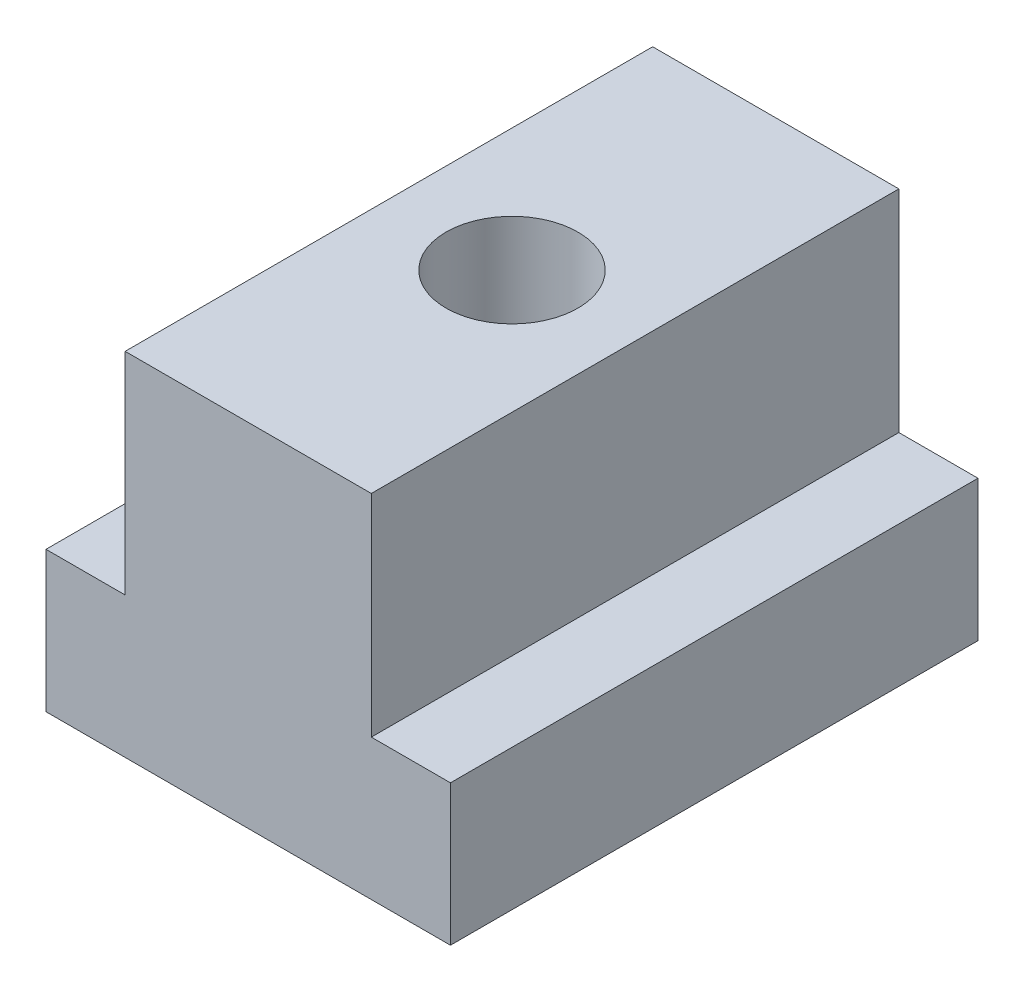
ISO-10303-21;
HEADER;
FILE_DESCRIPTION(('STEP AP214'),'2;1');
FILE_NAME('part.step','',(''),(''),'','','');
FILE_SCHEMA(('AUTOMOTIVE_DESIGN { 1 0 10303 214 1 1 1 1 }'));
ENDSEC;
DATA;
#1=APPLICATION_CONTEXT('core data for automotive mechanical design processes');
#2=APPLICATION_PROTOCOL_DEFINITION('international standard','automotive_design',2000,#1);
#3=PRODUCT_CONTEXT('',#1,'mechanical');
#4=PRODUCT('Part','Part','',(#3));
#5=PRODUCT_RELATED_PRODUCT_CATEGORY('part','',(#4));
#6=PRODUCT_DEFINITION_FORMATION('','',#4);
#7=PRODUCT_DEFINITION_CONTEXT('part definition',#1,'design');
#8=PRODUCT_DEFINITION('design','',#6,#7);
#9=PRODUCT_DEFINITION_SHAPE('','',#8);
#10=(LENGTH_UNIT() NAMED_UNIT(*) SI_UNIT(.MILLI.,.METRE.));
#11=(NAMED_UNIT(*) PLANE_ANGLE_UNIT() SI_UNIT($,.RADIAN.));
#12=(NAMED_UNIT(*) SI_UNIT($,.STERADIAN.) SOLID_ANGLE_UNIT());
#13=UNCERTAINTY_MEASURE_WITH_UNIT(LENGTH_MEASURE(1.E-05),#10,'distance_accuracy_value','');
#14=(GEOMETRIC_REPRESENTATION_CONTEXT(3) GLOBAL_UNCERTAINTY_ASSIGNED_CONTEXT((#13)) GLOBAL_UNIT_ASSIGNED_CONTEXT((#10,
#11,#12)) REPRESENTATION_CONTEXT('',''));
#15=CARTESIAN_POINT('',(0.,0.,0.));
#16=DIRECTION('',(0.,0.,1.));
#17=DIRECTION('',(1.,0.,0.));
#18=AXIS2_PLACEMENT_3D('',#15,#16,#17);
#19=CARTESIAN_POINT('',(-11.5,8.,15.));
#20=DIRECTION('',(0.,-1.,0.));
#21=DIRECTION('',(1.,0.,0.));
#22=AXIS2_PLACEMENT_3D('',#19,#20,#21);
#23=PLANE('',#22);
#24=DIRECTION('',(-1.,0.,0.));
#25=VECTOR('',#24,1.);
#26=CARTESIAN_POINT('',(-11.5,8.,-15.));
#27=LINE('',#26,#25);
#28=CARTESIAN_POINT('',(-7.,8.00000000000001,-15.));
#29=VERTEX_POINT('',#28);
#30=CARTESIAN_POINT('',(-11.5,8.,-15.));
#31=VERTEX_POINT('',#30);
#32=EDGE_CURVE('E127',#29,#31,#27,.T.);
#33=ORIENTED_EDGE('',*,*,#32,.T.);
#34=DIRECTION('',(0.,0.,-1.));
#35=VECTOR('',#34,1.);
#36=CARTESIAN_POINT('',(-11.5,8.,15.));
#37=LINE('',#36,#35);
#38=CARTESIAN_POINT('',(-11.5,8.,15.));
#39=VERTEX_POINT('',#38);
#40=EDGE_CURVE('E11',#39,#31,#37,.T.);
#41=ORIENTED_EDGE('',*,*,#40,.F.);
#42=DIRECTION('',(-1.,0.,0.));
#43=VECTOR('',#42,1.);
#44=CARTESIAN_POINT('',(-11.5,8.,15.));
#45=LINE('',#44,#43);
#46=CARTESIAN_POINT('',(-7.,8.00000000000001,15.));
#47=VERTEX_POINT('',#46);
#48=EDGE_CURVE('E142',#47,#39,#45,.T.);
#49=ORIENTED_EDGE('',*,*,#48,.F.);
#50=DIRECTION('',(0.,0.,-1.));
#51=VECTOR('',#50,1.);
#52=CARTESIAN_POINT('',(-7.,8.00000000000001,15.));
#53=LINE('',#52,#51);
#54=EDGE_CURVE('E123',#47,#29,#53,.T.);
#55=ORIENTED_EDGE('',*,*,#54,.T.);
#56=EDGE_LOOP('',(#33,#41,#49,#55));
#57=FACE_BOUND('',#56,.T.);
#58=ADVANCED_FACE('F31',(#57),#23,.F.);
#59=CARTESIAN_POINT('',(-11.5,0.,15.));
#60=DIRECTION('',(1.,0.,0.));
#61=DIRECTION('',(0.,1.,0.));
#62=AXIS2_PLACEMENT_3D('',#59,#60,#61);
#63=PLANE('',#62);
#64=DIRECTION('',(0.,-1.,0.));
#65=VECTOR('',#64,1.);
#66=CARTESIAN_POINT('',(-11.5,0.,-15.));
#67=LINE('',#66,#65);
#68=CARTESIAN_POINT('',(-11.5,0.,-15.));
#69=VERTEX_POINT('',#68);
#70=EDGE_CURVE('E130',#31,#69,#67,.T.);
#71=ORIENTED_EDGE('',*,*,#70,.T.);
#72=DIRECTION('',(0.,0.,-1.));
#73=VECTOR('',#72,1.);
#74=CARTESIAN_POINT('',(-11.5,0.,15.));
#75=LINE('',#74,#73);
#76=CARTESIAN_POINT('',(-11.5,0.,15.));
#77=VERTEX_POINT('',#76);
#78=EDGE_CURVE('E39',#77,#69,#75,.T.);
#79=ORIENTED_EDGE('',*,*,#78,.F.);
#80=DIRECTION('',(0.,-1.,0.));
#81=VECTOR('',#80,1.);
#82=CARTESIAN_POINT('',(-11.5,0.,15.));
#83=LINE('',#82,#81);
#84=EDGE_CURVE('E90',#39,#77,#83,.T.);
#85=ORIENTED_EDGE('',*,*,#84,.F.);
#86=ORIENTED_EDGE('',*,*,#40,.T.);
#87=EDGE_LOOP('',(#71,#79,#85,#86));
#88=FACE_BOUND('',#87,.T.);
#89=ADVANCED_FACE('F198',(#88),#63,.F.);
#90=CARTESIAN_POINT('',(-11.5,0.,15.));
#91=DIRECTION('',(0.,1.,0.));
#92=DIRECTION('',(-1.,0.,0.));
#93=AXIS2_PLACEMENT_3D('',#90,#91,#92);
#94=PLANE('',#93);
#95=CARTESIAN_POINT('',(0.,0.,0.));
#96=DIRECTION('',(0.,1.,0.));
#97=DIRECTION('',(-1.,0.,0.));
#98=AXIS2_PLACEMENT_3D('',#95,#96,#97);
#99=CIRCLE('',#98,3.75);
#100=CARTESIAN_POINT('',(-3.75,0.,0.));
#101=VERTEX_POINT('',#100);
#102=EDGE_CURVE('E131',#101,#101,#99,.T.);
#103=ORIENTED_EDGE('',*,*,#102,.T.);
#104=EDGE_LOOP('',(#103));
#105=FACE_BOUND('',#104,.T.);
#106=DIRECTION('',(1.,0.,0.));
#107=VECTOR('',#106,1.);
#108=CARTESIAN_POINT('',(-11.5,0.,-15.));
#109=LINE('',#108,#107);
#110=CARTESIAN_POINT('',(11.5,0.,-15.));
#111=VERTEX_POINT('',#110);
#112=EDGE_CURVE('E133',#69,#111,#109,.T.);
#113=ORIENTED_EDGE('',*,*,#112,.T.);
#114=DIRECTION('',(0.,0.,-1.));
#115=VECTOR('',#114,1.);
#116=CARTESIAN_POINT('',(11.5,0.,15.));
#117=LINE('',#116,#115);
#118=CARTESIAN_POINT('',(11.5,0.,15.));
#119=VERTEX_POINT('',#118);
#120=EDGE_CURVE('E149',#119,#111,#117,.T.);
#121=ORIENTED_EDGE('',*,*,#120,.F.);
#122=DIRECTION('',(1.,0.,0.));
#123=VECTOR('',#122,1.);
#124=CARTESIAN_POINT('',(-11.5,0.,15.));
#125=LINE('',#124,#123);
#126=EDGE_CURVE('E157',#77,#119,#125,.T.);
#127=ORIENTED_EDGE('',*,*,#126,.F.);
#128=ORIENTED_EDGE('',*,*,#78,.T.);
#129=EDGE_LOOP('',(#113,#121,#127,#128));
#130=FACE_BOUND('',#129,.T.);
#131=ADVANCED_FACE('F155',(#105,#130),#94,.F.);
#132=CARTESIAN_POINT('',(11.5,0.,15.));
#133=DIRECTION('',(-1.,0.,0.));
#134=DIRECTION('',(0.,0.,1.));
#135=AXIS2_PLACEMENT_3D('',#132,#133,#134);
#136=PLANE('',#135);
#137=DIRECTION('',(0.,1.,0.));
#138=VECTOR('',#137,1.);
#139=CARTESIAN_POINT('',(11.5,0.,-15.));
#140=LINE('',#139,#138);
#141=CARTESIAN_POINT('',(11.5,8.,-15.));
#142=VERTEX_POINT('',#141);
#143=EDGE_CURVE('E135',#111,#142,#140,.T.);
#144=ORIENTED_EDGE('',*,*,#143,.T.);
#145=DIRECTION('',(0.,0.,-1.));
#146=VECTOR('',#145,1.);
#147=CARTESIAN_POINT('',(11.5,8.,15.));
#148=LINE('',#147,#146);
#149=CARTESIAN_POINT('',(11.5,8.,15.));
#150=VERTEX_POINT('',#149);
#151=EDGE_CURVE('E146',#150,#142,#148,.T.);
#152=ORIENTED_EDGE('',*,*,#151,.F.);
#153=DIRECTION('',(0.,1.,0.));
#154=VECTOR('',#153,1.);
#155=CARTESIAN_POINT('',(11.5,0.,15.));
#156=LINE('',#155,#154);
#157=EDGE_CURVE('E169',#119,#150,#156,.T.);
#158=ORIENTED_EDGE('',*,*,#157,.F.);
#159=ORIENTED_EDGE('',*,*,#120,.T.);
#160=EDGE_LOOP('',(#144,#152,#158,#159));
#161=FACE_BOUND('',#160,.T.);
#162=ADVANCED_FACE('F165',(#161),#136,.F.);
#163=CARTESIAN_POINT('',(11.5,8.,15.));
#164=DIRECTION('',(0.,-1.,0.));
#165=DIRECTION('',(1.,0.,0.));
#166=AXIS2_PLACEMENT_3D('',#163,#164,#165);
#167=PLANE('',#166);
#168=DIRECTION('',(-1.,0.,0.));
#169=VECTOR('',#168,1.);
#170=CARTESIAN_POINT('',(11.5,8.,-15.));
#171=LINE('',#170,#169);
#172=CARTESIAN_POINT('',(7.,8.00000000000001,-15.));
#173=VERTEX_POINT('',#172);
#174=EDGE_CURVE('E137',#142,#173,#171,.T.);
#175=ORIENTED_EDGE('',*,*,#174,.T.);
#176=DIRECTION('',(0.,0.,-1.));
#177=VECTOR('',#176,1.);
#178=CARTESIAN_POINT('',(7.,8.00000000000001,15.));
#179=LINE('',#178,#177);
#180=CARTESIAN_POINT('',(7.,8.00000000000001,15.));
#181=VERTEX_POINT('',#180);
#182=EDGE_CURVE('E118',#181,#173,#179,.T.);
#183=ORIENTED_EDGE('',*,*,#182,.F.);
#184=DIRECTION('',(-1.,0.,0.));
#185=VECTOR('',#184,1.);
#186=CARTESIAN_POINT('',(11.5,8.,15.));
#187=LINE('',#186,#185);
#188=EDGE_CURVE('E109',#150,#181,#187,.T.);
#189=ORIENTED_EDGE('',*,*,#188,.F.);
#190=ORIENTED_EDGE('',*,*,#151,.T.);
#191=EDGE_LOOP('',(#175,#183,#189,#190));
#192=FACE_BOUND('',#191,.T.);
#193=ADVANCED_FACE('F168',(#192),#167,.F.);
#194=CARTESIAN_POINT('',(7.,8.00000000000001,15.));
#195=DIRECTION('',(-1.,0.,0.));
#196=DIRECTION('',(0.,-1.,0.));
#197=AXIS2_PLACEMENT_3D('',#194,#195,#196);
#198=PLANE('',#197);
#199=DIRECTION('',(0.,1.,0.));
#200=VECTOR('',#199,1.);
#201=CARTESIAN_POINT('',(7.,8.00000000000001,-15.));
#202=LINE('',#201,#200);
#203=CARTESIAN_POINT('',(7.,20.,-15.));
#204=VERTEX_POINT('',#203);
#205=EDGE_CURVE('E117',#173,#204,#202,.T.);
#206=ORIENTED_EDGE('',*,*,#205,.T.);
#207=DIRECTION('',(0.,0.,-1.));
#208=VECTOR('',#207,1.);
#209=CARTESIAN_POINT('',(7.,20.,15.));
#210=LINE('',#209,#208);
#211=CARTESIAN_POINT('',(7.,20.,15.));
#212=VERTEX_POINT('',#211);
#213=EDGE_CURVE('E114',#212,#204,#210,.T.);
#214=ORIENTED_EDGE('',*,*,#213,.F.);
#215=DIRECTION('',(0.,1.,0.));
#216=VECTOR('',#215,1.);
#217=CARTESIAN_POINT('',(7.,8.00000000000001,15.));
#218=LINE('',#217,#216);
#219=EDGE_CURVE('E103',#181,#212,#218,.T.);
#220=ORIENTED_EDGE('',*,*,#219,.F.);
#221=ORIENTED_EDGE('',*,*,#182,.T.);
#222=EDGE_LOOP('',(#206,#214,#220,#221));
#223=FACE_BOUND('',#222,.T.);
#224=ADVANCED_FACE('F115',(#223),#198,.F.);
#225=CARTESIAN_POINT('',(7.,20.,15.));
#226=DIRECTION('',(0.,-1.,0.));
#227=DIRECTION('',(1.,0.,0.));
#228=AXIS2_PLACEMENT_3D('',#225,#226,#227);
#229=PLANE('',#228);
#230=CARTESIAN_POINT('',(0.,20.,0.));
#231=DIRECTION('',(0.,1.,0.));
#232=DIRECTION('',(-1.,0.,0.));
#233=AXIS2_PLACEMENT_3D('',#230,#231,#232);
#234=CIRCLE('',#233,3.75);
#235=CARTESIAN_POINT('',(-3.75,20.,0.));
#236=VERTEX_POINT('',#235);
#237=EDGE_CURVE('E175',#236,#236,#234,.T.);
#238=ORIENTED_EDGE('',*,*,#237,.F.);
#239=EDGE_LOOP('',(#238));
#240=FACE_BOUND('',#239,.T.);
#241=DIRECTION('',(-1.,0.,0.));
#242=VECTOR('',#241,1.);
#243=CARTESIAN_POINT('',(7.,20.,-15.));
#244=LINE('',#243,#242);
#245=CARTESIAN_POINT('',(-7.00000000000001,20.,-15.));
#246=VERTEX_POINT('',#245);
#247=EDGE_CURVE('E76',#204,#246,#244,.T.);
#248=ORIENTED_EDGE('',*,*,#247,.T.);
#249=DIRECTION('',(0.,0.,-1.));
#250=VECTOR('',#249,1.);
#251=CARTESIAN_POINT('',(-7.00000000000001,20.,15.));
#252=LINE('',#251,#250);
#253=CARTESIAN_POINT('',(-7.00000000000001,20.,15.));
#254=VERTEX_POINT('',#253);
#255=EDGE_CURVE('E119',#254,#246,#252,.T.);
#256=ORIENTED_EDGE('',*,*,#255,.F.);
#257=DIRECTION('',(-1.,0.,0.));
#258=VECTOR('',#257,1.);
#259=CARTESIAN_POINT('',(7.,20.,15.));
#260=LINE('',#259,#258);
#261=EDGE_CURVE('E107',#212,#254,#260,.T.);
#262=ORIENTED_EDGE('',*,*,#261,.F.);
#263=ORIENTED_EDGE('',*,*,#213,.T.);
#264=EDGE_LOOP('',(#248,#256,#262,#263));
#265=FACE_BOUND('',#264,.T.);
#266=ADVANCED_FACE('F121',(#240,#265),#229,.F.);
#267=CARTESIAN_POINT('',(-7.,8.00000000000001,15.));
#268=DIRECTION('',(1.,0.,0.));
#269=DIRECTION('',(0.,1.,0.));
#270=AXIS2_PLACEMENT_3D('',#267,#268,#269);
#271=PLANE('',#270);
#272=DIRECTION('',(0.,-1.,0.));
#273=VECTOR('',#272,1.);
#274=CARTESIAN_POINT('',(-7.,8.00000000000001,-15.));
#275=LINE('',#274,#273);
#276=EDGE_CURVE('E82',#246,#29,#275,.T.);
#277=ORIENTED_EDGE('',*,*,#276,.T.);
#278=ORIENTED_EDGE('',*,*,#54,.F.);
#279=DIRECTION('',(0.,-1.,0.));
#280=VECTOR('',#279,1.);
#281=CARTESIAN_POINT('',(-7.,8.00000000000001,15.));
#282=LINE('',#281,#280);
#283=EDGE_CURVE('E47',#254,#47,#282,.T.);
#284=ORIENTED_EDGE('',*,*,#283,.F.);
#285=ORIENTED_EDGE('',*,*,#255,.T.);
#286=EDGE_LOOP('',(#277,#278,#284,#285));
#287=FACE_BOUND('',#286,.T.);
#288=ADVANCED_FACE('F189',(#287),#271,.F.);
#289=CARTESIAN_POINT('',(-7.,8.00000000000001,15.));
#290=DIRECTION('',(0.,0.,1.));
#291=DIRECTION('',(1.,0.,0.));
#292=AXIS2_PLACEMENT_3D('',#289,#290,#291);
#293=PLANE('',#292);
#294=ORIENTED_EDGE('',*,*,#48,.T.);
#295=ORIENTED_EDGE('',*,*,#84,.T.);
#296=ORIENTED_EDGE('',*,*,#126,.T.);
#297=ORIENTED_EDGE('',*,*,#157,.T.);
#298=ORIENTED_EDGE('',*,*,#188,.T.);
#299=ORIENTED_EDGE('',*,*,#219,.T.);
#300=ORIENTED_EDGE('',*,*,#261,.T.);
#301=ORIENTED_EDGE('',*,*,#283,.T.);
#302=EDGE_LOOP('',(#294,#295,#296,#297,#298,#299,#300,#301));
#303=FACE_BOUND('',#302,.T.);
#304=ADVANCED_FACE('F105',(#303),#293,.T.);
#305=CARTESIAN_POINT('',(-7.,8.00000000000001,-15.));
#306=DIRECTION('',(0.,0.,1.));
#307=DIRECTION('',(1.,0.,0.));
#308=AXIS2_PLACEMENT_3D('',#305,#306,#307);
#309=PLANE('',#308);
#310=ORIENTED_EDGE('',*,*,#32,.F.);
#311=ORIENTED_EDGE('',*,*,#276,.F.);
#312=ORIENTED_EDGE('',*,*,#247,.F.);
#313=ORIENTED_EDGE('',*,*,#205,.F.);
#314=ORIENTED_EDGE('',*,*,#174,.F.);
#315=ORIENTED_EDGE('',*,*,#143,.F.);
#316=ORIENTED_EDGE('',*,*,#112,.F.);
#317=ORIENTED_EDGE('',*,*,#70,.F.);
#318=EDGE_LOOP('',(#310,#311,#312,#313,#314,#315,#316,#317));
#319=FACE_BOUND('',#318,.T.);
#320=ADVANCED_FACE('F161',(#319),#309,.F.);
#321=CARTESIAN_POINT('',(0.,0.,0.));
#322=DIRECTION('',(0.,1.,0.));
#323=DIRECTION('',(-1.,0.,0.));
#324=AXIS2_PLACEMENT_3D('',#321,#322,#323);
#325=CYLINDRICAL_SURFACE('',#324,3.75);
#326=ORIENTED_EDGE('',*,*,#102,.F.);
#327=EDGE_LOOP('',(#326));
#328=FACE_BOUND('',#327,.T.);
#329=ORIENTED_EDGE('',*,*,#237,.T.);
#330=EDGE_LOOP('',(#329));
#331=FACE_BOUND('',#330,.T.);
#332=ADVANCED_FACE('F182',(#328,#331),#325,.F.);
#333=CLOSED_SHELL('',(#58,#89,#131,#162,#193,#224,#266,#288,#304,#320,#332));
#334=MANIFOLD_SOLID_BREP('B2',#333);
#335=ADVANCED_BREP_SHAPE_REPRESENTATION('',(#18,#334),#14);
#336=SHAPE_DEFINITION_REPRESENTATION(#9,#335);
ENDSEC;
END-ISO-10303-21;
